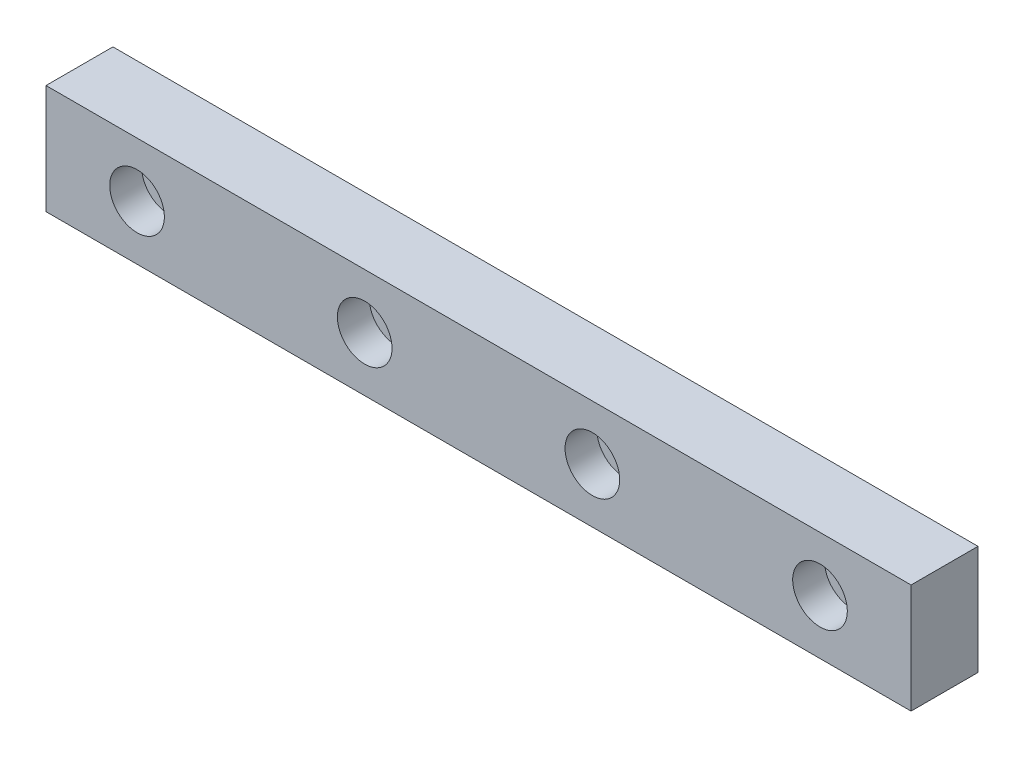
from build123d import *

# Parameters (mm, degrees)
SKETCH_1_W          = 95
SKETCH_1_H          = 12
SKETCH_1_R          = 1.75
EXTRUDE_1_DEPTH     = 7.35
SKETCH_2_R          = 3
CUT_EXTRUDE_1_DEPTH = 3.5


with BuildPart() as part:
    # Sketch 1 → Extrude 1 (new body)
    with BuildSketch(Plane.XY):
        with Locations((47.5, 6)):
            Rectangle(SKETCH_1_W, SKETCH_1_H)
        with Locations((85, 6)):
            Circle(SKETCH_1_R, mode=Mode.SUBTRACT)
        with Locations((10, 6)):
            Circle(SKETCH_1_R, mode=Mode.SUBTRACT)
        with Locations((35, 6)):
            Circle(SKETCH_1_R, mode=Mode.SUBTRACT)
        with Locations((60, 6)):
            Circle(SKETCH_1_R, mode=Mode.SUBTRACT)
    extrude(amount=EXTRUDE_1_DEPTH)

    # Sketch 2 → Cut-Extrude 1 (cut)
    with BuildSketch(Plane.XY.offset(7.35)):
        with Locations((85, 6)):
            Circle(SKETCH_2_R)
        with Locations((10, 6)):
            Circle(SKETCH_2_R)
        with Locations((35, 6)):
            Circle(SKETCH_2_R)
        with Locations((60, 6)):
            Circle(SKETCH_2_R)
    extrude(amount=-CUT_EXTRUDE_1_DEPTH, mode=Mode.SUBTRACT)


solid = part.part
